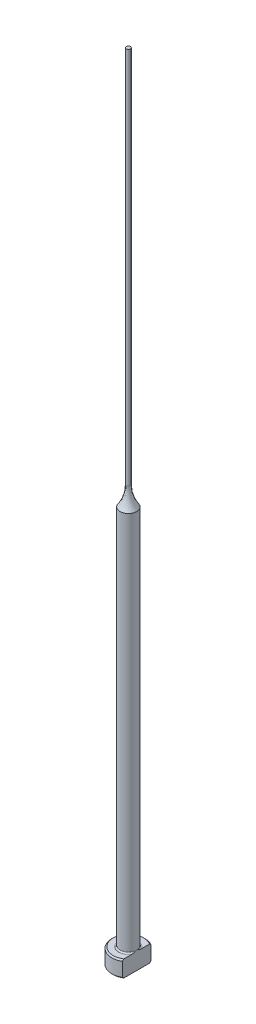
ISO-10303-21;
HEADER;
FILE_DESCRIPTION(('STEP AP214'),'2;1');
FILE_NAME('part.step','',(''),(''),'','','');
FILE_SCHEMA(('AUTOMOTIVE_DESIGN { 1 0 10303 214 1 1 1 1 }'));
ENDSEC;
DATA;
#1=APPLICATION_CONTEXT('core data for automotive mechanical design processes');
#2=APPLICATION_PROTOCOL_DEFINITION('international standard','automotive_design',2000,#1);
#3=PRODUCT_CONTEXT('',#1,'mechanical');
#4=PRODUCT('Part','Part','',(#3));
#5=PRODUCT_RELATED_PRODUCT_CATEGORY('part','',(#4));
#6=PRODUCT_DEFINITION_FORMATION('','',#4);
#7=PRODUCT_DEFINITION_CONTEXT('part definition',#1,'design');
#8=PRODUCT_DEFINITION('design','',#6,#7);
#9=PRODUCT_DEFINITION_SHAPE('','',#8);
#10=(LENGTH_UNIT() NAMED_UNIT(*) SI_UNIT(.MILLI.,.METRE.));
#11=(NAMED_UNIT(*) PLANE_ANGLE_UNIT() SI_UNIT($,.RADIAN.));
#12=(NAMED_UNIT(*) SI_UNIT($,.STERADIAN.) SOLID_ANGLE_UNIT());
#13=UNCERTAINTY_MEASURE_WITH_UNIT(LENGTH_MEASURE(1.E-05),#10,'distance_accuracy_value','');
#14=(GEOMETRIC_REPRESENTATION_CONTEXT(3) GLOBAL_UNCERTAINTY_ASSIGNED_CONTEXT((#13)) GLOBAL_UNIT_ASSIGNED_CONTEXT((#10,
#11,#12)) REPRESENTATION_CONTEXT('',''));
#15=CARTESIAN_POINT('',(0.,0.,0.));
#16=DIRECTION('',(0.,0.,1.));
#17=DIRECTION('',(1.,0.,0.));
#18=AXIS2_PLACEMENT_3D('',#15,#16,#17);
#19=CARTESIAN_POINT('',(-3.17499999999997,3.175,0.));
#20=DIRECTION('',(0.,1.,0.));
#21=DIRECTION('',(0.,0.,1.));
#22=AXIS2_PLACEMENT_3D('',#19,#20,#21);
#23=PLANE('',#22);
#24=CARTESIAN_POINT('',(0.,3.175,0.));
#25=DIRECTION('',(0.,1.,0.));
#26=DIRECTION('',(0.,0.,1.));
#27=AXIS2_PLACEMENT_3D('',#24,#25,#26);
#28=CIRCLE('',#27,2.92099999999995);
#29=CARTESIAN_POINT('',(1.58749999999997,3.175,-2.45195529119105));
#30=VERTEX_POINT('',#29);
#31=CARTESIAN_POINT('',(1.58749999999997,3.175,2.45195529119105));
#32=VERTEX_POINT('',#31);
#33=EDGE_CURVE('E105',#30,#32,#28,.T.);
#34=ORIENTED_EDGE('',*,*,#33,.T.);
#35=DIRECTION('',(0.,0.,1.));
#36=VECTOR('',#35,1.);
#37=CARTESIAN_POINT('',(1.58749999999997,3.17500000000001,2.74963065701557));
#38=LINE('',#37,#36);
#39=CARTESIAN_POINT('',(1.58749999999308,3.175,0.933255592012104));
#40=VERTEX_POINT('',#39);
#41=EDGE_CURVE('E126',#40,#32,#38,.T.);
#42=ORIENTED_EDGE('',*,*,#41,.F.);
#43=CARTESIAN_POINT('',(0.,3.175,0.));
#44=DIRECTION('',(0.,1.,0.));
#45=DIRECTION('',(0.,0.,1.));
#46=AXIS2_PLACEMENT_3D('',#43,#44,#45);
#47=CIRCLE('',#46,1.84149999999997);
#48=CARTESIAN_POINT('',(1.58749999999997,3.17500000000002,-0.933255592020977));
#49=VERTEX_POINT('',#48);
#50=EDGE_CURVE('E11',#40,#49,#47,.F.);
#51=ORIENTED_EDGE('',*,*,#50,.T.);
#52=EDGE_CURVE('E52',#30,#49,#38,.T.);
#53=ORIENTED_EDGE('',*,*,#52,.F.);
#54=EDGE_LOOP('',(#34,#42,#51,#53));
#55=FACE_BOUND('',#54,.T.);
#56=ADVANCED_FACE('F32',(#55),#23,.T.);
#57=CARTESIAN_POINT('',(0.,259.958771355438,0.));
#58=DIRECTION('',(0.,1.,0.));
#59=DIRECTION('',(0.,0.,1.));
#60=AXIS2_PLACEMENT_3D('',#57,#58,#59);
#61=CYLINDRICAL_SURFACE('',#60,3.17499999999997);
#62=CARTESIAN_POINT('',(0.,2.92100000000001,0.));
#63=DIRECTION('',(0.,1.,0.));
#64=DIRECTION('',(0.,0.,1.));
#65=AXIS2_PLACEMENT_3D('',#62,#63,#64);
#66=CIRCLE('',#65,3.17499999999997);
#67=CARTESIAN_POINT('',(1.58749999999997,2.92100000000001,2.74963065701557));
#68=VERTEX_POINT('',#67);
#69=CARTESIAN_POINT('',(1.58749999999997,2.92100000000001,-2.74963065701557));
#70=VERTEX_POINT('',#69);
#71=EDGE_CURVE('E98',#68,#70,#66,.F.);
#72=ORIENTED_EDGE('',*,*,#71,.T.);
#73=DIRECTION('',(0.,-1.,0.));
#74=VECTOR('',#73,1.);
#75=CARTESIAN_POINT('',(1.58749999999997,152.401,-2.74963065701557));
#76=LINE('',#75,#74);
#77=CARTESIAN_POINT('',(1.58749999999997,0.254000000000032,-2.74963065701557));
#78=VERTEX_POINT('',#77);
#79=EDGE_CURVE('E141',#70,#78,#76,.T.);
#80=ORIENTED_EDGE('',*,*,#79,.T.);
#81=CARTESIAN_POINT('',(0.,0.254000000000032,0.));
#82=DIRECTION('',(0.,-1.,0.));
#83=DIRECTION('',(0.,0.,-1.));
#84=AXIS2_PLACEMENT_3D('',#81,#82,#83);
#85=CIRCLE('',#84,3.17499999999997);
#86=CARTESIAN_POINT('',(1.58749999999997,0.254000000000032,2.74963065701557));
#87=VERTEX_POINT('',#86);
#88=EDGE_CURVE('E95',#78,#87,#85,.F.);
#89=ORIENTED_EDGE('',*,*,#88,.T.);
#90=DIRECTION('',(0.,-1.,0.));
#91=VECTOR('',#90,1.);
#92=CARTESIAN_POINT('',(1.58749999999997,152.401,2.74963065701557));
#93=LINE('',#92,#91);
#94=EDGE_CURVE('E88',#68,#87,#93,.T.);
#95=ORIENTED_EDGE('',*,*,#94,.F.);
#96=EDGE_LOOP('',(#72,#80,#89,#95));
#97=FACE_BOUND('',#96,.T.);
#98=ADVANCED_FACE('F191',(#97),#61,.T.);
#99=CARTESIAN_POINT('',(0.,0.,0.));
#100=DIRECTION('',(0.,-1.,0.));
#101=DIRECTION('',(0.,0.,-1.));
#102=AXIS2_PLACEMENT_3D('',#99,#100,#101);
#103=PLANE('',#102);
#104=CARTESIAN_POINT('',(0.,0.,0.));
#105=DIRECTION('',(0.,-1.,0.));
#106=DIRECTION('',(0.,0.,-1.));
#107=AXIS2_PLACEMENT_3D('',#104,#105,#106);
#108=CIRCLE('',#107,2.92099999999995);
#109=CARTESIAN_POINT('',(1.58749999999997,0.,2.45195529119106));
#110=VERTEX_POINT('',#109);
#111=CARTESIAN_POINT('',(1.58749999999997,0.,-2.45195529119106));
#112=VERTEX_POINT('',#111);
#113=EDGE_CURVE('E93',#110,#112,#108,.T.);
#114=ORIENTED_EDGE('',*,*,#113,.T.);
#115=DIRECTION('',(0.,0.,1.));
#116=VECTOR('',#115,1.);
#117=CARTESIAN_POINT('',(1.58749999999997,0.,2.74963065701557));
#118=LINE('',#117,#116);
#119=EDGE_CURVE('E78',#112,#110,#118,.T.);
#120=ORIENTED_EDGE('',*,*,#119,.T.);
#121=EDGE_LOOP('',(#114,#120));
#122=FACE_BOUND('',#121,.T.);
#123=ADVANCED_FACE('F97',(#122),#103,.T.);
#124=CARTESIAN_POINT('',(0.,3.17499999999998,0.));
#125=DIRECTION('',(0.,-1.,0.));
#126=DIRECTION('',(0.,0.,-1.));
#127=AXIS2_PLACEMENT_3D('',#124,#125,#126);
#128=CONICAL_SURFACE('',#127,2.92099999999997,0.7853981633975);
#129=ORIENTED_EDGE('',*,*,#71,.F.);
#130=CARTESIAN_POINT('',(1.58749999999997,-0.161620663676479,-6.0529050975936));
#131=CARTESIAN_POINT('',(1.58749999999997,-0.0288893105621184,-5.91567682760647));
#132=CARTESIAN_POINT('',(1.58749999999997,0.103699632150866,-5.77831035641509));
#133=CARTESIAN_POINT('',(1.58749999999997,0.36850839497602,-5.5032187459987));
#134=CARTESIAN_POINT('',(1.58749999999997,0.500728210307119,-5.36549360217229));
#135=CARTESIAN_POINT('',(1.58749999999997,0.764778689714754,-5.08953516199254));
#136=CARTESIAN_POINT('',(1.58749999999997,0.896609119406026,-4.95130164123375));
#137=CARTESIAN_POINT('',(1.58749999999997,1.15968706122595,-4.67428233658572));
#138=CARTESIAN_POINT('',(1.58749999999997,1.29093457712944,-4.53549655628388));
#139=CARTESIAN_POINT('',(1.58749999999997,1.55007705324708,-4.25997724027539));
#140=CARTESIAN_POINT('',(1.58749999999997,1.67798684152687,-4.12325766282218));
#141=CARTESIAN_POINT('',(1.58749999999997,1.93284861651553,-3.84892898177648));
#142=CARTESIAN_POINT('',(1.58749999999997,2.05980060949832,-3.71131988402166));
#143=CARTESIAN_POINT('',(1.58749999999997,2.31237508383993,-3.43493978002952));
#144=CARTESIAN_POINT('',(1.58749999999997,2.43799784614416,-3.29616903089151));
#145=CARTESIAN_POINT('',(1.58749999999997,2.68741369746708,-3.01699558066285));
#146=CARTESIAN_POINT('',(1.58749999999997,2.81120686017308,-2.87659294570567));
#147=CARTESIAN_POINT('',(1.58749999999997,3.0087586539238,-2.6481670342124));
#148=CARTESIAN_POINT('',(1.58749999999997,3.08336151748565,-2.56087478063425));
#149=CARTESIAN_POINT('',(1.58749999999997,3.23123871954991,-2.38515423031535));
#150=CARTESIAN_POINT('',(1.58749999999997,3.30451292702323,-2.29672582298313));
#151=CARTESIAN_POINT('',(1.58749999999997,3.45004422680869,-2.1174740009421));
#152=CARTESIAN_POINT('',(1.58749999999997,3.52228237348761,-2.02663514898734));
#153=CARTESIAN_POINT('',(1.58749999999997,3.6642309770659,-1.8430252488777));
#154=CARTESIAN_POINT('',(1.58749999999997,3.73394203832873,-1.75025467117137));
#155=CARTESIAN_POINT('',(1.58749999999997,3.87080633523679,-1.56067475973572));
#156=CARTESIAN_POINT('',(1.58749999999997,3.93790459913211,-1.46382547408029));
#157=CARTESIAN_POINT('',(1.58749999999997,4.06669147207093,-1.26632594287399));
#158=CARTESIAN_POINT('',(1.58749999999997,4.12837264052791,-1.16567073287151));
#159=CARTESIAN_POINT('',(1.58749999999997,4.2140225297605,-1.01165766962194));
#160=CARTESIAN_POINT('',(1.58749999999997,4.24127929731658,-0.960142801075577));
#161=CARTESIAN_POINT('',(1.58749999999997,4.29309798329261,-0.855780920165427));
#162=CARTESIAN_POINT('',(1.58749999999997,4.31765941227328,-0.802933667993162));
#163=CARTESIAN_POINT('',(1.58749999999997,4.38614656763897,-0.64246114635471));
#164=CARTESIAN_POINT('',(1.58749999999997,4.42510149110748,-0.532518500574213));
#165=CARTESIAN_POINT('',(1.58749999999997,4.46726244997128,-0.367680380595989));
#166=CARTESIAN_POINT('',(1.58749999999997,4.47844427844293,-0.314802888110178));
#167=CARTESIAN_POINT('',(1.58749999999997,4.495766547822,-0.2082097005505));
#168=CARTESIAN_POINT('',(1.58749999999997,4.50190743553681,-0.154494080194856));
#169=CARTESIAN_POINT('',(1.58749999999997,4.50871296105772,-0.0468792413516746));
#170=CARTESIAN_POINT('',(1.58749999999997,4.50939451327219,0.0070188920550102));
#171=CARTESIAN_POINT('',(1.58749999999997,4.50527679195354,0.114606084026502));
#172=CARTESIAN_POINT('',(1.58749999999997,4.50047706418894,0.168295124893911));
#173=CARTESIAN_POINT('',(1.58749999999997,4.48579689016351,0.274485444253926));
#174=CARTESIAN_POINT('',(1.58749999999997,4.47596081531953,0.326992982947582));
#175=CARTESIAN_POINT('',(1.58749999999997,4.45181809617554,0.430974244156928));
#176=CARTESIAN_POINT('',(1.58749999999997,4.43750969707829,0.48244755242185));
#177=CARTESIAN_POINT('',(1.58749999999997,4.40502489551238,0.584460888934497));
#178=CARTESIAN_POINT('',(1.58749999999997,4.38682724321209,0.634994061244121));
#179=CARTESIAN_POINT('',(1.58749999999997,4.34729308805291,0.734789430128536));
#180=CARTESIAN_POINT('',(1.58749999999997,4.32595722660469,0.784051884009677));
#181=CARTESIAN_POINT('',(1.58749999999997,4.25791922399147,0.930549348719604));
#182=CARTESIAN_POINT('',(1.58749999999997,4.20736047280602,1.02598802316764));
#183=CARTESIAN_POINT('',(1.58749999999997,4.09955451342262,1.2130431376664));
#184=CARTESIAN_POINT('',(1.58749999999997,4.04229912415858,1.30465471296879));
#185=CARTESIAN_POINT('',(1.58749999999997,3.9230874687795,1.4852621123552));
#186=CARTESIAN_POINT('',(1.58749999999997,3.86111349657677,1.57424615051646));
#187=CARTESIAN_POINT('',(1.58749999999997,3.73408621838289,1.74990003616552));
#188=CARTESIAN_POINT('',(1.58749999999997,3.66903444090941,1.8365709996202));
#189=CARTESIAN_POINT('',(1.58749999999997,3.53583371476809,2.00931764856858));
#190=CARTESIAN_POINT('',(1.58749999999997,3.46765527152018,2.09537048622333));
#191=CARTESIAN_POINT('',(1.58749999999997,3.32960643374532,2.26611736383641));
#192=CARTESIAN_POINT('',(1.58749999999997,3.25973586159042,2.35081125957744));
#193=CARTESIAN_POINT('',(1.58749999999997,3.04858139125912,2.60290121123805));
#194=CARTESIAN_POINT('',(1.58749999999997,2.90542388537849,2.76872537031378));
#195=CARTESIAN_POINT('',(1.58749999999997,2.64069522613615,3.06970913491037));
#196=CARTESIAN_POINT('',(1.58749999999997,2.5195945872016,3.20528660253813));
#197=CARTESIAN_POINT('',(1.58749999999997,2.275904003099,3.47510321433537));
#198=CARTESIAN_POINT('',(1.58749999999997,2.15331401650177,3.60934232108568));
#199=CARTESIAN_POINT('',(1.58749999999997,1.90694239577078,3.87695374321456));
#200=CARTESIAN_POINT('',(1.58749999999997,1.78315974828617,4.01032512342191));
#201=CARTESIAN_POINT('',(1.58749999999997,1.53478104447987,4.2763088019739));
#202=CARTESIAN_POINT('',(1.58749999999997,1.41018498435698,4.40892109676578));
#203=CARTESIAN_POINT('',(1.58749999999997,1.0457468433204,4.79499418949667));
#204=CARTESIAN_POINT('',(1.58749999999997,0.805076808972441,5.04767313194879));
#205=CARTESIAN_POINT('',(1.58749999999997,0.443121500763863,5.42550911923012));
#206=CARTESIAN_POINT('',(1.58749999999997,0.322378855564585,5.55118772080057));
#207=CARTESIAN_POINT('',(1.58749999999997,0.0805914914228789,5.80225207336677));
#208=CARTESIAN_POINT('',(1.58749999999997,-0.0404532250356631,5.92763782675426));
#209=CARTESIAN_POINT('',(1.58749999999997,-0.161620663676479,6.0529050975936));
#210=B_SPLINE_CURVE_WITH_KNOTS('',3,(#130,#131,#132,#133,#134,#135,#136,#137,#138,#139,#140,
#141,#142,#143,#144,#145,#146,#147,#148,#149,#150,#151,#152,#153,#154,#155,#156,#157,#158,#159,
#160,#161,#162,#163,#164,#165,#166,#167,#168,#169,#170,#171,#172,#173,#174,#175,#176,#177,#178,
#179,#180,#181,#182,#183,#184,#185,#186,#187,#188,#189,#190,#191,#192,#193,#194,#195,#196,#197,
#198,#199,#200,#201,#202,#203,#204,#205,#206,#207,#208,#209),.UNSPECIFIED.,.F.,.F.,(4,2,2,2,2,2,
2,2,2,2,2,2,2,2,2,2,2,2,2,2,2,2,2,2,2,2,2,2,2,2,2,2,2,2,2,2,2,2,2,4),(0.,0.572750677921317,
1.14550874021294,1.71856057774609,2.29160869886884,2.85328006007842,3.41494773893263,
3.97649423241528,4.53801804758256,4.88249307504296,5.22700189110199,5.57515326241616,
5.92322081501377,6.27657800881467,6.63041319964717,6.80518126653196,6.97998101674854,
7.32824262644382,7.49018491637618,7.65211285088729,7.813538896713,7.97497832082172,
8.13501929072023,8.29512313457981,8.4561251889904,8.61709438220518,8.94062993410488,
9.26456495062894,9.58978187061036,9.91483894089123,10.2441741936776,10.5735441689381,
11.2306812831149,11.7760337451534,12.3214014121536,12.8672825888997,13.4131663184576,
14.4600164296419,14.9828595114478,15.505698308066),.UNSPECIFIED.);
#211=EDGE_CURVE('E118',#32,#68,#210,.T.);
#212=ORIENTED_EDGE('',*,*,#211,.F.);
#213=ORIENTED_EDGE('',*,*,#33,.F.);
#214=EDGE_CURVE('E117',#70,#30,#210,.T.);
#215=ORIENTED_EDGE('',*,*,#214,.F.);
#216=EDGE_LOOP('',(#129,#212,#213,#215));
#217=FACE_BOUND('',#216,.T.);
#218=ADVANCED_FACE('F162',(#217),#128,.T.);
#219=CARTESIAN_POINT('',(0.,0.254000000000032,0.));
#220=DIRECTION('',(0.,1.,0.));
#221=DIRECTION('',(0.,0.,1.));
#222=AXIS2_PLACEMENT_3D('',#219,#220,#221);
#223=CONICAL_SURFACE('',#222,3.17499999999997,0.785398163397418);
#224=ORIENTED_EDGE('',*,*,#88,.F.);
#225=CARTESIAN_POINT('',(1.58749999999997,3.33662066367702,6.0529050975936));
#226=CARTESIAN_POINT('',(1.58749999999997,3.20388931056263,5.91567682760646));
#227=CARTESIAN_POINT('',(1.58749999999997,3.0713003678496,5.77831035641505));
#228=CARTESIAN_POINT('',(1.58749999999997,2.80649160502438,5.50321874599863));
#229=CARTESIAN_POINT('',(1.58749999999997,2.67427178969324,5.36549360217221));
#230=CARTESIAN_POINT('',(1.58749999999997,2.41022131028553,5.08953516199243));
#231=CARTESIAN_POINT('',(1.58749999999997,2.27839088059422,4.95130164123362));
#232=CARTESIAN_POINT('',(1.58749999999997,2.01531293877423,4.67428233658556));
#233=CARTESIAN_POINT('',(1.58749999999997,1.8840654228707,4.5354965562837));
#234=CARTESIAN_POINT('',(1.58749999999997,1.62492294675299,4.25997724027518));
#235=CARTESIAN_POINT('',(1.58749999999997,1.49701315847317,4.12325766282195));
#236=CARTESIAN_POINT('',(1.58749999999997,1.24215138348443,3.84892898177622));
#237=CARTESIAN_POINT('',(1.58749999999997,1.11519939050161,3.71131988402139));
#238=CARTESIAN_POINT('',(1.58749999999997,0.862624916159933,3.43493978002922));
#239=CARTESIAN_POINT('',(1.58749999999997,0.737002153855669,3.29616903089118));
#240=CARTESIAN_POINT('',(1.58749999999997,0.487586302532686,3.01699558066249));
#241=CARTESIAN_POINT('',(1.58749999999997,0.363793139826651,2.8765929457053));
#242=CARTESIAN_POINT('',(1.58749999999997,0.1662413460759,2.64816703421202));
#243=CARTESIAN_POINT('',(1.58749999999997,0.0916384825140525,2.56087478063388));
#244=CARTESIAN_POINT('',(1.58749999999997,-0.0562387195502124,2.385154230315));
#245=CARTESIAN_POINT('',(1.58749999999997,-0.129512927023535,2.29672582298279));
#246=CARTESIAN_POINT('',(1.58749999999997,-0.275044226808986,2.11747400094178));
#247=CARTESIAN_POINT('',(1.58749999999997,-0.34728237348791,2.02663514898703));
#248=CARTESIAN_POINT('',(1.58749999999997,-0.489230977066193,1.84302524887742));
#249=CARTESIAN_POINT('',(1.58749999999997,-0.558942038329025,1.75025467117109));
#250=CARTESIAN_POINT('',(1.58749999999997,-0.695806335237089,1.56067475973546));
#251=CARTESIAN_POINT('',(1.58749999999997,-0.762904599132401,1.46382547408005));
#252=CARTESIAN_POINT('',(1.58749999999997,-0.89169147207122,1.26632594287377));
#253=CARTESIAN_POINT('',(1.58749999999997,-0.953372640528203,1.16567073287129));
#254=CARTESIAN_POINT('',(1.58749999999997,-1.03902252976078,1.01165766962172));
#255=CARTESIAN_POINT('',(1.58749999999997,-1.06627929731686,0.960142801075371));
#256=CARTESIAN_POINT('',(1.58749999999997,-1.11809798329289,0.855780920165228));
#257=CARTESIAN_POINT('',(1.58749999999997,-1.14265941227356,0.802933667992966));
#258=CARTESIAN_POINT('',(1.58749999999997,-1.21114656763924,0.642461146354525));
#259=CARTESIAN_POINT('',(1.58749999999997,-1.25010149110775,0.532518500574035));
#260=CARTESIAN_POINT('',(1.58749999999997,-1.29226244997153,0.36768038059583));
#261=CARTESIAN_POINT('',(1.58749999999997,-1.30344427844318,0.31480288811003));
#262=CARTESIAN_POINT('',(1.58749999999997,-1.32076654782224,0.208209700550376));
#263=CARTESIAN_POINT('',(1.58749999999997,-1.32690743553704,0.154494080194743));
#264=CARTESIAN_POINT('',(1.58749999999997,-1.33371296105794,0.0468792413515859));
#265=CARTESIAN_POINT('',(1.58749999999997,-1.33439451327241,-0.0070188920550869));
#266=CARTESIAN_POINT('',(1.58749999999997,-1.33027679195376,-0.114606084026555));
#267=CARTESIAN_POINT('',(1.58749999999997,-1.32547706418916,-0.168295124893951));
#268=CARTESIAN_POINT('',(1.58749999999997,-1.31079689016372,-0.274485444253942));
#269=CARTESIAN_POINT('',(1.58749999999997,-1.30096081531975,-0.326992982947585));
#270=CARTESIAN_POINT('',(1.58749999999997,-1.27681809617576,-0.430974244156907));
#271=CARTESIAN_POINT('',(1.58749999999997,-1.26250969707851,-0.482447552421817));
#272=CARTESIAN_POINT('',(1.58749999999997,-1.2300248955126,-0.584460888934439));
#273=CARTESIAN_POINT('',(1.58749999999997,-1.21182724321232,-0.634994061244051));
#274=CARTESIAN_POINT('',(1.58749999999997,-1.17229308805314,-0.734789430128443));
#275=CARTESIAN_POINT('',(1.58749999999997,-1.15095722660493,-0.784051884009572));
#276=CARTESIAN_POINT('',(1.58749999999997,-1.08291922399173,-0.93054934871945));
#277=CARTESIAN_POINT('',(1.58749999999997,-1.0323604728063,-1.02598802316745));
#278=CARTESIAN_POINT('',(1.58749999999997,-0.92455451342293,-1.21304313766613));
#279=CARTESIAN_POINT('',(1.58749999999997,-0.867299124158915,-1.30465471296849));
#280=CARTESIAN_POINT('',(1.58749999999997,-0.748087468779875,-1.48526211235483));
#281=CARTESIAN_POINT('',(1.58749999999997,-0.686113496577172,-1.57424615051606));
#282=CARTESIAN_POINT('',(1.58749999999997,-0.559086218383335,-1.74990003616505));
#283=CARTESIAN_POINT('',(1.58749999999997,-0.494034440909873,-1.83657099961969));
#284=CARTESIAN_POINT('',(1.58749999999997,-0.360833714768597,-2.00931764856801));
#285=CARTESIAN_POINT('',(1.58749999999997,-0.292655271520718,-2.09537048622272));
#286=CARTESIAN_POINT('',(1.58749999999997,-0.154606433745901,-2.26611736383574));
#287=CARTESIAN_POINT('',(1.58749999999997,-0.084735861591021,-2.35081125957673));
#288=CARTESIAN_POINT('',(1.58749999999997,0.126418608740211,-2.60290121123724));
#289=CARTESIAN_POINT('',(1.58749999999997,0.26957611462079,-2.76872537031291));
#290=CARTESIAN_POINT('',(1.58749999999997,0.534304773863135,-3.06970913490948));
#291=CARTESIAN_POINT('',(1.58749999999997,0.655405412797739,-3.20528660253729));
#292=CARTESIAN_POINT('',(1.58749999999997,0.899095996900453,-3.47510321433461));
#293=CARTESIAN_POINT('',(1.58749999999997,1.02168598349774,-3.60934232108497));
#294=CARTESIAN_POINT('',(1.58749999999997,1.26805760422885,-3.87695374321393));
#295=CARTESIAN_POINT('',(1.58749999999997,1.39184025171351,-4.01032512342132));
#296=CARTESIAN_POINT('',(1.58749999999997,1.64021895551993,-4.2763088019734));
#297=CARTESIAN_POINT('',(1.58749999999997,1.76481501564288,-4.40892109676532));
#298=CARTESIAN_POINT('',(1.58749999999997,2.12925315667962,-4.79499418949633));
#299=CARTESIAN_POINT('',(1.58749999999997,2.36992319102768,-5.04767313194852));
#300=CARTESIAN_POINT('',(1.58749999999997,2.73187849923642,-5.42550911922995));
#301=CARTESIAN_POINT('',(1.58749999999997,2.85262114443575,-5.55118772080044));
#302=CARTESIAN_POINT('',(1.58749999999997,3.09440850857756,-5.8022520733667));
#303=CARTESIAN_POINT('',(1.58749999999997,3.21545322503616,-5.92763782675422));
#304=CARTESIAN_POINT('',(1.58749999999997,3.33662066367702,-6.0529050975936));
#305=B_SPLINE_CURVE_WITH_KNOTS('',3,(#225,#226,#227,#228,#229,#230,#231,#232,#233,#234,#235,
#236,#237,#238,#239,#240,#241,#242,#243,#244,#245,#246,#247,#248,#249,#250,#251,#252,#253,#254,
#255,#256,#257,#258,#259,#260,#261,#262,#263,#264,#265,#266,#267,#268,#269,#270,#271,#272,#273,
#274,#275,#276,#277,#278,#279,#280,#281,#282,#283,#284,#285,#286,#287,#288,#289,#290,#291,#292,
#293,#294,#295,#296,#297,#298,#299,#300,#301,#302,#303,#304),.UNSPECIFIED.,.F.,.F.,(4,2,2,2,2,2,
2,2,2,2,2,2,2,2,2,2,2,2,2,2,2,2,2,2,2,2,2,2,2,2,2,2,2,2,2,2,2,2,2,4),(0.,0.572750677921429,
1.14550874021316,1.71856057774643,2.29160869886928,2.85328006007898,3.41494773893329,
3.97649423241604,4.53801804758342,4.8824930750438,5.22700189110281,5.57515326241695,
5.92322081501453,6.27657800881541,6.63041319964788,6.80518126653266,6.97998101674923,
7.32824262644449,7.49018491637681,7.65211285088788,7.81353889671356,7.97497832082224,
8.13501929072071,8.29512313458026,8.45612518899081,8.61709438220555,8.94062993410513,
9.26456495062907,9.58978187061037,9.91483894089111,10.2441741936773,10.5735441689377,
11.2306812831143,11.776033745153,12.3214014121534,12.8672825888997,13.4131663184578,
14.4600164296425,14.9828595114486,15.505698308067),.UNSPECIFIED.);
#306=EDGE_CURVE('E81',#112,#78,#305,.T.);
#307=ORIENTED_EDGE('',*,*,#306,.F.);
#308=ORIENTED_EDGE('',*,*,#113,.F.);
#309=EDGE_CURVE('E84',#87,#110,#305,.T.);
#310=ORIENTED_EDGE('',*,*,#309,.F.);
#311=EDGE_LOOP('',(#224,#307,#308,#310));
#312=FACE_BOUND('',#311,.T.);
#313=ADVANCED_FACE('F92',(#312),#223,.T.);
#314=CARTESIAN_POINT('',(0.,3.42900000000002,0.));
#315=DIRECTION('',(0.,1.,0.));
#316=DIRECTION('',(0.,0.,1.));
#317=AXIS2_PLACEMENT_3D('',#314,#315,#316);
#318=TOROIDAL_SURFACE('',#317,1.84149999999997,0.254);
#319=CARTESIAN_POINT('',(1.58749999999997,3.42900000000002,0.));
#320=CARTESIAN_POINT('',(1.58749999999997,3.42899942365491,-1.9220514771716E-10));
#321=CARTESIAN_POINT('',(1.58749999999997,3.42899884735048,-1.2261161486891E-07));
#322=CARTESIAN_POINT('',(1.58749999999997,3.42899773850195,-5.09676365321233E-07));
#323=CARTESIAN_POINT('',(1.58749999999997,3.42899720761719,-7.78176328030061E-07));
#324=CARTESIAN_POINT('',(1.58749999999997,3.42899614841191,-1.42307272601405E-06));
#325=CARTESIAN_POINT('',(1.58749999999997,3.42899562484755,-1.80713867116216E-06));
#326=CARTESIAN_POINT('',(1.58749999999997,3.42899463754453,-2.63494846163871E-06));
#327=CARTESIAN_POINT('',(1.58749999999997,3.42899417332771,-3.07814756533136E-06));
#328=CARTESIAN_POINT('',(1.58749999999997,3.42899261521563,-4.66897357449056E-06));
#329=CARTESIAN_POINT('',(1.58749999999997,3.42899159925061,-5.89404908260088E-06));
#330=CARTESIAN_POINT('',(1.58749999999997,3.42898979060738,-8.42427511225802E-06));
#331=CARTESIAN_POINT('',(1.58749999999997,3.42898899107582,-9.7248057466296E-06));
#332=CARTESIAN_POINT('',(1.58749999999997,3.42898598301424,-1.48060601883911E-05));
#333=CARTESIAN_POINT('',(1.58749999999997,3.42898393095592,-1.86838281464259E-05));
#334=CARTESIAN_POINT('',(1.58749999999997,3.42898057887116,-2.63261117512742E-05));
#335=CARTESIAN_POINT('',(1.58749999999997,3.42897922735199,-3.00687417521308E-05));
#336=CARTESIAN_POINT('',(1.58749999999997,3.42897347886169,-4.60276298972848E-05));
#337=CARTESIAN_POINT('',(1.58749999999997,3.42896911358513,-5.8247019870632E-05));
#338=CARTESIAN_POINT('',(1.58749999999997,3.42896211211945,-8.11070097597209E-05));
#339=CARTESIAN_POINT('',(1.58749999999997,3.42895931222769,-9.16953114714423E-05));
#340=CARTESIAN_POINT('',(1.58749999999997,3.42893712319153,-0.000168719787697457));
#341=CARTESIAN_POINT('',(1.58749999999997,3.42890881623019,-0.000232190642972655));
#342=CARTESIAN_POINT('',(1.58749999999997,3.42880276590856,-0.000479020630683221));
#343=CARTESIAN_POINT('',(1.58749999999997,3.42873165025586,-0.00066443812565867));
#344=CARTESIAN_POINT('',(1.58749999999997,3.42845137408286,-0.0013844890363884));
#345=CARTESIAN_POINT('',(1.58749999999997,3.42823526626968,-0.00191701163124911));
#346=CARTESIAN_POINT('',(1.58749999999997,3.42735449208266,-0.00409774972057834));
#347=CARTESIAN_POINT('',(1.58749999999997,3.42669768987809,-0.00574830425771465));
#348=CARTESIAN_POINT('',(1.58749999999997,3.4174405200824,-0.0289985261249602));
#349=CARTESIAN_POINT('',(1.58749999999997,3.40878325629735,-0.0505816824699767));
#350=CARTESIAN_POINT('',(1.58749999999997,3.39189297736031,-0.0929947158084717));
#351=CARTESIAN_POINT('',(1.58749999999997,3.38365605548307,-0.11382315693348));
#352=CARTESIAN_POINT('',(1.58749999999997,3.36635393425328,-0.157956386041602));
#353=CARTESIAN_POINT('',(1.58749999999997,3.35730391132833,-0.181267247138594));
#354=CARTESIAN_POINT('',(1.58749999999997,3.33936775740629,-0.228222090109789));
#355=CARTESIAN_POINT('',(1.58749999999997,3.33048420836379,-0.25186705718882));
#356=CARTESIAN_POINT('',(1.58749999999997,3.30894496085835,-0.310512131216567));
#357=CARTESIAN_POINT('',(1.58749999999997,3.29649449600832,-0.345588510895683));
#358=CARTESIAN_POINT('',(1.58749999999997,3.27296975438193,-0.415278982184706));
#359=CARTESIAN_POINT('',(1.58749999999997,3.26186987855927,-0.449884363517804));
#360=CARTESIAN_POINT('',(1.58749999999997,3.2395832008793,-0.524471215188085));
#361=CARTESIAN_POINT('',(1.58749999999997,3.22860862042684,-0.564517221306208));
#362=CARTESIAN_POINT('',(1.58749999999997,3.20902534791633,-0.645529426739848));
#363=CARTESIAN_POINT('',(1.58749999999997,3.20043582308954,-0.686500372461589));
#364=CARTESIAN_POINT('',(1.58749999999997,3.18611712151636,-0.771546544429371));
#365=CARTESIAN_POINT('',(1.58749999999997,3.18059550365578,-0.815658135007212));
#366=CARTESIAN_POINT('',(1.58749999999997,3.17455396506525,-0.904117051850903));
#367=CARTESIAN_POINT('',(1.58749999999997,3.17401361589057,-0.948462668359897));
#368=CARTESIAN_POINT('',(1.58749999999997,3.17898948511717,-1.02531896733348));
#369=CARTESIAN_POINT('',(1.58749999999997,3.1829739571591,-1.05792141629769));
#370=CARTESIAN_POINT('',(1.58749999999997,3.19569167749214,-1.12184393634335));
#371=CARTESIAN_POINT('',(1.58749999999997,3.20436049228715,-1.1531753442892));
#372=CARTESIAN_POINT('',(1.58749999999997,3.22236152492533,-1.19946468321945));
#373=CARTESIAN_POINT('',(1.58749999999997,3.2295150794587,-1.21526783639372));
#374=CARTESIAN_POINT('',(1.58749999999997,3.24587062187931,-1.24583726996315));
#375=CARTESIAN_POINT('',(1.58749999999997,3.25507530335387,-1.26060215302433));
#376=CARTESIAN_POINT('',(1.58749999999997,3.27378481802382,-1.28575815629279));
#377=CARTESIAN_POINT('',(1.58749999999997,3.28289001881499,-1.29644383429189));
#378=CARTESIAN_POINT('',(1.58749999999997,3.30268460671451,-1.31623154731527));
#379=CARTESIAN_POINT('',(1.58749999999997,3.31337067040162,-1.32533681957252));
#380=CARTESIAN_POINT('',(1.58749999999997,3.33349977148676,-1.33941140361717));
#381=CARTESIAN_POINT('',(1.58749999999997,3.34261446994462,-1.34484814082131));
#382=CARTESIAN_POINT('',(1.58749999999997,3.36161455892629,-1.35416329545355));
#383=CARTESIAN_POINT('',(1.58749999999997,3.37149946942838,-1.35804267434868));
#384=CARTESIAN_POINT('',(1.58749999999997,3.39188678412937,-1.36398436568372));
#385=CARTESIAN_POINT('',(1.58749999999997,3.40239309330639,-1.36603350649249));
#386=CARTESIAN_POINT('',(1.58749999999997,3.42360372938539,-1.3680840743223));
#387=CARTESIAN_POINT('',(1.58749999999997,3.43430795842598,-1.36808648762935));
#388=CARTESIAN_POINT('',(1.58749999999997,3.45433283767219,-1.36616208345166));
#389=CARTESIAN_POINT('',(1.58749999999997,3.46367506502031,-1.36444960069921));
#390=CARTESIAN_POINT('',(1.58749999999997,3.48195519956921,-1.35953338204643));
#391=CARTESIAN_POINT('',(1.58749999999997,3.49089304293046,-1.3563294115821));
#392=CARTESIAN_POINT('',(1.58749999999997,3.50850302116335,-1.34848006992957));
#393=CARTESIAN_POINT('',(1.58749999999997,3.5171531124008,-1.34378578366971));
#394=CARTESIAN_POINT('',(1.58749999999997,3.53371257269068,-1.33324445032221));
#395=CARTESIAN_POINT('',(1.58749999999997,3.54162163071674,-1.32739692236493));
#396=CARTESIAN_POINT('',(1.58749999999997,3.56107121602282,-1.31107304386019));
#397=CARTESIAN_POINT('',(1.58749999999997,3.57202221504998,-1.29989286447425));
#398=CARTESIAN_POINT('',(1.58749999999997,3.59202509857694,-1.27593566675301));
#399=CARTESIAN_POINT('',(1.58749999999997,3.60107086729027,-1.26315370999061));
#400=CARTESIAN_POINT('',(1.58749999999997,3.62186023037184,-1.22930733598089));
#401=CARTESIAN_POINT('',(1.58749999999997,3.63240584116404,-1.20751096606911));
#402=CARTESIAN_POINT('',(1.58749999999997,3.65004643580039,-1.16266144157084));
#403=CARTESIAN_POINT('',(1.58749999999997,3.65714435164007,-1.13960937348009));
#404=CARTESIAN_POINT('',(1.58749999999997,3.67265428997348,-1.07603916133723));
#405=CARTESIAN_POINT('',(1.58749999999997,3.67834921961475,-1.03486686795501));
#406=CARTESIAN_POINT('',(1.58749999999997,3.68382880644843,-0.951558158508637));
#407=CARTESIAN_POINT('',(1.58749999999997,3.68350976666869,-0.909417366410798));
#408=CARTESIAN_POINT('',(1.58749999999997,3.67745397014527,-0.811383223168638));
#409=CARTESIAN_POINT('',(1.58749999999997,3.66993873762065,-0.755610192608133));
#410=CARTESIAN_POINT('',(1.58749999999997,3.64933373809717,-0.644937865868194));
#411=CARTESIAN_POINT('',(1.58749999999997,3.63621897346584,-0.59004364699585));
#412=CARTESIAN_POINT('',(1.58749999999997,3.60740922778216,-0.485757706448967));
#413=CARTESIAN_POINT('',(1.58749999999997,3.59201096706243,-0.436281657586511));
#414=CARTESIAN_POINT('',(1.58749999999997,3.55922497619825,-0.338551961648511));
#415=CARTESIAN_POINT('',(1.58749999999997,3.5418584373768,-0.290291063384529));
#416=CARTESIAN_POINT('',(1.58749999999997,3.51760237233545,-0.225557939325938));
#417=CARTESIAN_POINT('',(1.58749999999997,3.51126413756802,-0.208874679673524));
#418=CARTESIAN_POINT('',(1.58749999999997,3.49830042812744,-0.17512392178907));
#419=CARTESIAN_POINT('',(1.58749999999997,3.49167176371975,-0.158057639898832));
#420=CARTESIAN_POINT('',(1.58749999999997,3.47585523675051,-0.117638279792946));
#421=CARTESIAN_POINT('',(1.58749999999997,3.46662970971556,-0.0943002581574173));
#422=CARTESIAN_POINT('',(1.58749999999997,3.44889695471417,-0.0497824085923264));
#423=CARTESIAN_POINT('',(1.58749999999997,3.44040039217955,-0.028598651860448));
#424=CARTESIAN_POINT('',(1.58749999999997,3.43130364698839,-0.00575168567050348));
#425=CARTESIAN_POINT('',(1.58749999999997,3.43064818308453,-0.00410451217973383));
#426=CARTESIAN_POINT('',(1.58749999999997,3.42976776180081,-0.00192459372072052));
#427=CARTESIAN_POINT('',(1.58749999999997,3.42955062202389,-0.00138952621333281));
#428=CARTESIAN_POINT('',(1.58749999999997,3.42926908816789,-0.000666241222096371));
#429=CARTESIAN_POINT('',(1.58749999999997,3.42919771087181,-0.000480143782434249));
#430=CARTESIAN_POINT('',(1.58749999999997,3.42909131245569,-0.000232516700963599));
#431=CARTESIAN_POINT('',(1.58749999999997,3.42906294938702,-0.000168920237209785));
#432=CARTESIAN_POINT('',(1.58749999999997,3.42904072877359,-9.17527162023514E-05));
#433=CARTESIAN_POINT('',(1.58749999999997,3.42903792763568,-8.11550293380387E-05));
#434=CARTESIAN_POINT('',(1.58749999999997,3.42903091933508,-5.82743948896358E-05));
#435=CARTESIAN_POINT('',(1.58749999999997,3.42902654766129,-4.60440001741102E-05));
#436=CARTESIAN_POINT('',(1.58749999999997,3.42902079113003,-3.00727682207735E-05));
#437=CARTESIAN_POINT('',(1.58749999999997,3.42901943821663,-2.63286807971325E-05));
#438=CARTESIAN_POINT('',(1.58749999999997,3.42901608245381,-1.86836529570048E-05));
#439=CARTESIAN_POINT('',(1.58749999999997,3.4290140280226,-1.48046517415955E-05));
#440=CARTESIAN_POINT('',(1.58749999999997,3.42901101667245,-9.72223943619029E-06));
#441=CARTESIAN_POINT('',(1.58749999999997,3.42901021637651,-8.42159649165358E-06));
#442=CARTESIAN_POINT('',(1.58749999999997,3.42900840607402,-5.89129729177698E-06));
#443=CARTESIAN_POINT('',(1.58749999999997,3.42900738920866,-4.66626867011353E-06));
#444=CARTESIAN_POINT('',(1.58749999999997,3.42900582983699,-3.07568803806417E-06));
#445=CARTESIAN_POINT('',(1.58749999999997,3.42900536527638,-2.63259565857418E-06));
#446=CARTESIAN_POINT('',(1.58749999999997,3.4290043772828,-1.80506085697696E-06));
#447=CARTESIAN_POINT('',(1.58749999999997,3.42900385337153,-1.42116387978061E-06));
#448=CARTESIAN_POINT('',(1.58749999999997,3.42900279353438,-7.76675643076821E-07));
#449=CARTESIAN_POINT('',(1.58749999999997,3.42900226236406,-5.08406487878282E-07));
#450=CARTESIAN_POINT('',(1.58749999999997,3.42900115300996,-1.21901887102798E-07));
#451=CARTESIAN_POINT('',(1.58749999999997,3.42900057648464,1.92251677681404E-10));
#452=CARTESIAN_POINT('',(1.58749999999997,3.42900000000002,0.));
#453=B_SPLINE_CURVE_WITH_KNOTS('',3,(#319,#320,#321,#322,#323,#324,#325,#326,#327,#328,#329,
#330,#331,#332,#333,#334,#335,#336,#337,#338,#339,#340,#341,#342,#343,#344,#345,#346,#347,#348,
#349,#350,#351,#352,#353,#354,#355,#356,#357,#358,#359,#360,#361,#362,#363,#364,#365,#366,#367,
#368,#369,#370,#371,#372,#373,#374,#375,#376,#377,#378,#379,#380,#381,#382,#383,#384,#385,#386,
#387,#388,#389,#390,#391,#392,#393,#394,#395,#396,#397,#398,#399,#400,#401,#402,#403,#404,#405,
#406,#407,#408,#409,#410,#411,#412,#413,#414,#415,#416,#417,#418,#419,#420,#421,#422,#423,#424,
#425,#426,#427,#428,#429,#430,#431,#432,#433,#434,#435,#436,#437,#438,#439,#440,#441,#442,#443,
#444,#445,#446,#447,#448,#449,#450,#451,#452),.UNSPECIFIED.,.T.,.F.,(4,2,2,2,2,2,2,2,2,2,2,2,2,
2,2,2,2,2,2,2,2,2,2,2,2,2,2,2,2,2,2,2,2,2,2,2,2,2,2,2,2,2,2,2,2,2,2,2,2,2,2,2,2,2,2,2,2,2,2,2,2,
2,2,2,2,2,4),(0.,1.72815458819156E-06,3.50429255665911E-06,5.44431004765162E-06,
7.3675525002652E-06,1.2119089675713E-05,1.66953775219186E-05,2.98160400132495E-05,
4.17409564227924E-05,8.0660475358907E-05,0.000113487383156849,0.000321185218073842,
0.000917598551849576,0.00264089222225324,0.00797105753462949,0.0777276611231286,
0.144923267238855,0.219939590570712,0.295714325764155,0.407362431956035,0.516367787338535,
0.640878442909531,0.766362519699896,0.899536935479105,1.03216495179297,1.13045740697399,
1.22743103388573,1.27935899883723,1.33135556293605,1.37333248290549,1.41522237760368,
1.44693946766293,1.47863694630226,1.51056074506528,1.54246916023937,1.57083210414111,
1.59919951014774,1.62861579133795,1.65804436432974,1.70472658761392,1.75155645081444,
1.82378709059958,1.89595619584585,2.01995471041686,2.1460932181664,2.31447224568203,
2.48361094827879,2.6389891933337,2.79283011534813,2.84637031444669,2.9012946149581,
2.97658236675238,3.04504771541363,3.05036697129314,3.05209849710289,3.05269709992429,
3.05290520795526,3.05293806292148,3.05297701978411,3.05298895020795,3.05300207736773,
3.05300665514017,3.0530114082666,3.05301333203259,3.05301527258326,3.05301704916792,
3.05301877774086),.UNSPECIFIED.);
#454=CARTESIAN_POINT('',(1.58749999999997,3.42900000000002,0.));
#455=VERTEX_POINT('',#454);
#456=EDGE_CURVE('E47',#455,#49,#453,.T.);
#457=ORIENTED_EDGE('',*,*,#456,.T.);
#458=ORIENTED_EDGE('',*,*,#50,.F.);
#459=CARTESIAN_POINT('',(1.58749999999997,3.42900000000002,0.));
#460=CARTESIAN_POINT('',(1.58749999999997,3.42900057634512,1.9220512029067E-10));
#461=CARTESIAN_POINT('',(1.58749999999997,3.42900115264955,1.22611614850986E-07));
#462=CARTESIAN_POINT('',(1.58749999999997,3.42900226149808,5.09676365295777E-07));
#463=CARTESIAN_POINT('',(1.58749999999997,3.42900279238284,7.78176328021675E-07));
#464=CARTESIAN_POINT('',(1.58749999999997,3.42900385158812,1.42307272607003E-06));
#465=CARTESIAN_POINT('',(1.58749999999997,3.42900437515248,1.80713867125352E-06));
#466=CARTESIAN_POINT('',(1.58749999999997,3.4290053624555,2.63494846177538E-06));
#467=CARTESIAN_POINT('',(1.58749999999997,3.42900582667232,3.0781475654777E-06));
#468=CARTESIAN_POINT('',(1.58749999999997,3.4290073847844,4.66897357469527E-06));
#469=CARTESIAN_POINT('',(1.58749999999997,3.42900840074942,5.89404908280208E-06));
#470=CARTESIAN_POINT('',(1.58749999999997,3.42901020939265,8.42427511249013E-06));
#471=CARTESIAN_POINT('',(1.58749999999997,3.42901100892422,9.72480574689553E-06));
#472=CARTESIAN_POINT('',(1.58749999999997,3.42901401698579,1.48060601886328E-05));
#473=CARTESIAN_POINT('',(1.58749999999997,3.42901606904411,1.86838281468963E-05));
#474=CARTESIAN_POINT('',(1.58749999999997,3.42901942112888,2.63261117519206E-05));
#475=CARTESIAN_POINT('',(1.58749999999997,3.42902077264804,3.00687417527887E-05));
#476=CARTESIAN_POINT('',(1.58749999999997,3.42902652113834,4.60276298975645E-05));
#477=CARTESIAN_POINT('',(1.58749999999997,3.4290308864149,5.82470198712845E-05));
#478=CARTESIAN_POINT('',(1.58749999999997,3.42903788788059,8.11070097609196E-05));
#479=CARTESIAN_POINT('',(1.58749999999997,3.42904068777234,9.16953114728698E-05));
#480=CARTESIAN_POINT('',(1.58749999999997,3.4290628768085,0.000168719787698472));
#481=CARTESIAN_POINT('',(1.58749999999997,3.42909118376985,0.000232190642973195));
#482=CARTESIAN_POINT('',(1.58749999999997,3.42919723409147,0.000479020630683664));
#483=CARTESIAN_POINT('',(1.58749999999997,3.42926834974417,0.000664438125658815));
#484=CARTESIAN_POINT('',(1.58749999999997,3.42954862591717,0.00138448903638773));
#485=CARTESIAN_POINT('',(1.58749999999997,3.42976473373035,0.00191701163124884));
#486=CARTESIAN_POINT('',(1.58749999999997,3.43064550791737,0.00409774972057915));
#487=CARTESIAN_POINT('',(1.58749999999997,3.43130231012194,0.00574830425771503));
#488=CARTESIAN_POINT('',(1.58749999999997,3.44055947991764,0.0289985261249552));
#489=CARTESIAN_POINT('',(1.58749999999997,3.44921674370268,0.0505816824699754));
#490=CARTESIAN_POINT('',(1.58749999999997,3.46610702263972,0.0929947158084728));
#491=CARTESIAN_POINT('',(1.58749999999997,3.47434394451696,0.11382315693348));
#492=CARTESIAN_POINT('',(1.58749999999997,3.49164606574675,0.157956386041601));
#493=CARTESIAN_POINT('',(1.58749999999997,3.5006960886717,0.181267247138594));
#494=CARTESIAN_POINT('',(1.58749999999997,3.51863224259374,0.228222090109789));
#495=CARTESIAN_POINT('',(1.58749999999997,3.52751579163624,0.25186705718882));
#496=CARTESIAN_POINT('',(1.58749999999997,3.54905503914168,0.310512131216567));
#497=CARTESIAN_POINT('',(1.58749999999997,3.56150550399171,0.345588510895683));
#498=CARTESIAN_POINT('',(1.58749999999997,3.5850302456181,0.415278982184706));
#499=CARTESIAN_POINT('',(1.58749999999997,3.59613012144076,0.449884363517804));
#500=CARTESIAN_POINT('',(1.58749999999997,3.61841679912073,0.524471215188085));
#501=CARTESIAN_POINT('',(1.58749999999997,3.62939137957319,0.564517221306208));
#502=CARTESIAN_POINT('',(1.58749999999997,3.6489746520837,0.645529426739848));
#503=CARTESIAN_POINT('',(1.58749999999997,3.65756417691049,0.686500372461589));
#504=CARTESIAN_POINT('',(1.58749999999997,3.67188287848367,0.771546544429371));
#505=CARTESIAN_POINT('',(1.58749999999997,3.67740449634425,0.815658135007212));
#506=CARTESIAN_POINT('',(1.58749999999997,3.68344603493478,0.904117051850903));
#507=CARTESIAN_POINT('',(1.58749999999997,3.68398638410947,0.948462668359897));
#508=CARTESIAN_POINT('',(1.58749999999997,3.67901051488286,1.02531896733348));
#509=CARTESIAN_POINT('',(1.58749999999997,3.67502604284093,1.05792141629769));
#510=CARTESIAN_POINT('',(1.58749999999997,3.66230832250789,1.12184393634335));
#511=CARTESIAN_POINT('',(1.58749999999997,3.65363950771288,1.1531753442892));
#512=CARTESIAN_POINT('',(1.58749999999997,3.6356384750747,1.19946468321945));
#513=CARTESIAN_POINT('',(1.58749999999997,3.62848492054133,1.21526783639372));
#514=CARTESIAN_POINT('',(1.58749999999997,3.61212937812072,1.24583726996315));
#515=CARTESIAN_POINT('',(1.58749999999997,3.60292469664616,1.26060215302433));
#516=CARTESIAN_POINT('',(1.58749999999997,3.58421518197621,1.28575815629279));
#517=CARTESIAN_POINT('',(1.58749999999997,3.57510998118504,1.29644383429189));
#518=CARTESIAN_POINT('',(1.58749999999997,3.55531539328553,1.31623154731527));
#519=CARTESIAN_POINT('',(1.58749999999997,3.54462932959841,1.32533681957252));
#520=CARTESIAN_POINT('',(1.58749999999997,3.52450022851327,1.33941140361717));
#521=CARTESIAN_POINT('',(1.58749999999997,3.51538553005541,1.34484814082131));
#522=CARTESIAN_POINT('',(1.58749999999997,3.49638544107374,1.35416329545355));
#523=CARTESIAN_POINT('',(1.58749999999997,3.48650053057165,1.35804267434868));
#524=CARTESIAN_POINT('',(1.58749999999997,3.46611321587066,1.36398436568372));
#525=CARTESIAN_POINT('',(1.58749999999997,3.45560690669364,1.36603350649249));
#526=CARTESIAN_POINT('',(1.58749999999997,3.43439627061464,1.3680840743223));
#527=CARTESIAN_POINT('',(1.58749999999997,3.42369204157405,1.36808648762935));
#528=CARTESIAN_POINT('',(1.58749999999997,3.40366716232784,1.36616208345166));
#529=CARTESIAN_POINT('',(1.58749999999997,3.39432493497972,1.36444960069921));
#530=CARTESIAN_POINT('',(1.58749999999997,3.37604480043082,1.35953338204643));
#531=CARTESIAN_POINT('',(1.58749999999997,3.36710695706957,1.3563294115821));
#532=CARTESIAN_POINT('',(1.58749999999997,3.34949697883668,1.34848006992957));
#533=CARTESIAN_POINT('',(1.58749999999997,3.34084688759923,1.34378578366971));
#534=CARTESIAN_POINT('',(1.58749999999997,3.32428742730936,1.33324445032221));
#535=CARTESIAN_POINT('',(1.58749999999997,3.31637836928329,1.32739692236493));
#536=CARTESIAN_POINT('',(1.58749999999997,3.29692878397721,1.31107304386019));
#537=CARTESIAN_POINT('',(1.58749999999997,3.28597778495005,1.29989286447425));
#538=CARTESIAN_POINT('',(1.58749999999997,3.26597490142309,1.27593566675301));
#539=CARTESIAN_POINT('',(1.58749999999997,3.25692913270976,1.26315370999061));
#540=CARTESIAN_POINT('',(1.58749999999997,3.23613976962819,1.22930733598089));
#541=CARTESIAN_POINT('',(1.58749999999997,3.22559415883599,1.20751096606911));
#542=CARTESIAN_POINT('',(1.58749999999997,3.20795356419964,1.16266144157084));
#543=CARTESIAN_POINT('',(1.58749999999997,3.20085564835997,1.13960937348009));
#544=CARTESIAN_POINT('',(1.58749999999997,3.18534571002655,1.07603916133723));
#545=CARTESIAN_POINT('',(1.58749999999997,3.17965078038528,1.03486686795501));
#546=CARTESIAN_POINT('',(1.58749999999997,3.1741711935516,0.951558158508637));
#547=CARTESIAN_POINT('',(1.58749999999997,3.17449023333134,0.909417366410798));
#548=CARTESIAN_POINT('',(1.58749999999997,3.18054602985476,0.811383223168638));
#549=CARTESIAN_POINT('',(1.58749999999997,3.18806126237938,0.755610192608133));
#550=CARTESIAN_POINT('',(1.58749999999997,3.20866626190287,0.644937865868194));
#551=CARTESIAN_POINT('',(1.58749999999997,3.2217810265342,0.59004364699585));
#552=CARTESIAN_POINT('',(1.58749999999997,3.25059077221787,0.485757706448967));
#553=CARTESIAN_POINT('',(1.58749999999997,3.2659890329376,0.43628165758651));
#554=CARTESIAN_POINT('',(1.58749999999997,3.29877502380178,0.338551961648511));
#555=CARTESIAN_POINT('',(1.58749999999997,3.31614156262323,0.290291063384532));
#556=CARTESIAN_POINT('',(1.58749999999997,3.34039762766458,0.225557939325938));
#557=CARTESIAN_POINT('',(1.58749999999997,3.346735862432,0.208874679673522));
#558=CARTESIAN_POINT('',(1.58749999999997,3.35969957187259,0.175123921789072));
#559=CARTESIAN_POINT('',(1.58749999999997,3.3663282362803,0.15805763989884));
#560=CARTESIAN_POINT('',(1.58749999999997,3.3821447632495,0.117638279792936));
#561=CARTESIAN_POINT('',(1.58749999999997,3.39137029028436,0.0943002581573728));
#562=CARTESIAN_POINT('',(1.58749999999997,3.40910304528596,0.0497824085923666));
#563=CARTESIAN_POINT('',(1.58749999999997,3.41759960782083,0.0285986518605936));
#564=CARTESIAN_POINT('',(1.58749999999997,3.42669635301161,0.00575168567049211));
#565=CARTESIAN_POINT('',(1.58749999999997,3.42735181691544,0.00410451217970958));
#566=CARTESIAN_POINT('',(1.58749999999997,3.42823223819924,0.00192459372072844));
#567=CARTESIAN_POINT('',(1.58749999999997,3.42844937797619,0.00138952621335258));
#568=CARTESIAN_POINT('',(1.58749999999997,3.42873091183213,0.000666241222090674));
#569=CARTESIAN_POINT('',(1.58749999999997,3.42880228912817,0.000480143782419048));
#570=CARTESIAN_POINT('',(1.58749999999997,3.42890868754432,0.000232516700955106));
#571=CARTESIAN_POINT('',(1.58749999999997,3.42893705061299,0.000168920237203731));
#572=CARTESIAN_POINT('',(1.58749999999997,3.42895927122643,9.17527161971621E-05));
#573=CARTESIAN_POINT('',(1.58749999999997,3.42896207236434,8.1155029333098E-05));
#574=CARTESIAN_POINT('',(1.58749999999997,3.42896908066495,5.82743948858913E-05));
#575=CARTESIAN_POINT('',(1.58749999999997,3.42897345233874,4.60440001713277E-05));
#576=CARTESIAN_POINT('',(1.58749999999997,3.42897920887,3.00727682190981E-05));
#577=CARTESIAN_POINT('',(1.58749999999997,3.42898056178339,2.63286807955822E-05));
#578=CARTESIAN_POINT('',(1.58749999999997,3.42898391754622,1.86836529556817E-05));
#579=CARTESIAN_POINT('',(1.58749999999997,3.42898597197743,1.48046517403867E-05));
#580=CARTESIAN_POINT('',(1.58749999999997,3.42898898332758,9.72223943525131E-06));
#581=CARTESIAN_POINT('',(1.58749999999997,3.42898978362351,8.42159649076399E-06));
#582=CARTESIAN_POINT('',(1.58749999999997,3.42899159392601,5.89129729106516E-06));
#583=CARTESIAN_POINT('',(1.58749999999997,3.42899261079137,4.66626866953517E-06));
#584=CARTESIAN_POINT('',(1.58749999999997,3.42899417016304,3.0756880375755E-06));
#585=CARTESIAN_POINT('',(1.58749999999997,3.42899463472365,2.63259565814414E-06));
#586=CARTESIAN_POINT('',(1.58749999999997,3.42899562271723,1.80506085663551E-06));
#587=CARTESIAN_POINT('',(1.58749999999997,3.42899614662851,1.42116387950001E-06));
#588=CARTESIAN_POINT('',(1.58749999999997,3.42899720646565,7.7667564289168E-07));
#589=CARTESIAN_POINT('',(1.58749999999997,3.42899773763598,5.0840648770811E-07));
#590=CARTESIAN_POINT('',(1.58749999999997,3.42899884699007,1.21901887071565E-07));
#591=CARTESIAN_POINT('',(1.58749999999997,3.42899942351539,-1.92251650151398E-10));
#592=CARTESIAN_POINT('',(1.58749999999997,3.42900000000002,0.));
#593=B_SPLINE_CURVE_WITH_KNOTS('',3,(#459,#460,#461,#462,#463,#464,#465,#466,#467,#468,#469,
#470,#471,#472,#473,#474,#475,#476,#477,#478,#479,#480,#481,#482,#483,#484,#485,#486,#487,#488,
#489,#490,#491,#492,#493,#494,#495,#496,#497,#498,#499,#500,#501,#502,#503,#504,#505,#506,#507,
#508,#509,#510,#511,#512,#513,#514,#515,#516,#517,#518,#519,#520,#521,#522,#523,#524,#525,#526,
#527,#528,#529,#530,#531,#532,#533,#534,#535,#536,#537,#538,#539,#540,#541,#542,#543,#544,#545,
#546,#547,#548,#549,#550,#551,#552,#553,#554,#555,#556,#557,#558,#559,#560,#561,#562,#563,#564,
#565,#566,#567,#568,#569,#570,#571,#572,#573,#574,#575,#576,#577,#578,#579,#580,#581,#582,#583,
#584,#585,#586,#587,#588,#589,#590,#591,#592),.UNSPECIFIED.,.T.,.F.,(4,2,2,2,2,2,2,2,2,2,2,2,2,
2,2,2,2,2,2,2,2,2,2,2,2,2,2,2,2,2,2,2,2,2,2,2,2,2,2,2,2,2,2,2,2,2,2,2,2,2,2,2,2,2,2,2,2,2,2,2,2,
2,2,2,2,2,4),(0.,1.72815458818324E-06,3.50429255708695E-06,5.44431004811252E-06,
7.36755250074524E-06,1.21190896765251E-05,1.66953775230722E-05,2.98160400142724E-05,
4.17409564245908E-05,8.06604753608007E-05,0.000113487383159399,0.000321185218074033,
0.000917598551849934,0.00264089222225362,0.00797105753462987,0.077727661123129,
0.144923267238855,0.219939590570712,0.295714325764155,0.407362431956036,0.516367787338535,
0.640878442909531,0.766362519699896,0.899536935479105,1.03216495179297,1.13045740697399,
1.22743103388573,1.27935899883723,1.33135556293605,1.37333248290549,1.41522237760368,
1.44693946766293,1.47863694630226,1.51056074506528,1.54246916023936,1.57083210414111,
1.59919951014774,1.62861579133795,1.65804436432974,1.70472658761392,1.75155645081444,
1.82378709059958,1.89595619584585,2.01995471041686,2.1460932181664,2.31447224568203,
2.48361094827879,2.6389891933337,2.79283011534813,2.84637031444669,2.9012946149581,
2.97658236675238,3.04504771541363,3.05036697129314,3.05209849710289,3.05269709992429,
3.05290520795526,3.05293806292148,3.05297701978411,3.05298895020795,3.05300207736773,
3.05300665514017,3.0530114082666,3.05301333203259,3.05301527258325,3.05301704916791,
3.05301877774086),.UNSPECIFIED.);
#594=EDGE_CURVE('E147',#40,#455,#593,.T.);
#595=ORIENTED_EDGE('',*,*,#594,.T.);
#596=CARTESIAN_POINT('',(0.,3.42900000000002,0.));
#597=DIRECTION('',(0.,1.,0.));
#598=DIRECTION('',(0.,0.,1.));
#599=AXIS2_PLACEMENT_3D('',#596,#597,#598);
#600=CIRCLE('',#599,1.58749999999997);
#601=EDGE_CURVE('E40',#455,#455,#600,.T.);
#602=ORIENTED_EDGE('',*,*,#601,.F.);
#603=EDGE_LOOP('',(#457,#458,#595,#602));
#604=FACE_BOUND('',#603,.T.);
#605=ADVANCED_FACE('F34',(#604),#318,.F.);
#606=CARTESIAN_POINT('',(-0.396239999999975,152.4,0.));
#607=DIRECTION('',(0.,1.,0.));
#608=DIRECTION('',(0.,0.,1.));
#609=AXIS2_PLACEMENT_3D('',#606,#607,#608);
#610=PLANE('',#609);
#611=CARTESIAN_POINT('',(0.,152.4,0.));
#612=DIRECTION('',(0.,1.,0.));
#613=DIRECTION('',(0.,0.,1.));
#614=AXIS2_PLACEMENT_3D('',#611,#612,#613);
#615=CIRCLE('',#614,0.396239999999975);
#616=CARTESIAN_POINT('',(0.,152.4,0.396239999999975));
#617=VERTEX_POINT('',#616);
#618=EDGE_CURVE('E108',#617,#617,#615,.T.);
#619=ORIENTED_EDGE('',*,*,#618,.T.);
#620=EDGE_LOOP('',(#619));
#621=FACE_BOUND('',#620,.T.);
#622=ADVANCED_FACE('F180',(#621),#610,.T.);
#623=CARTESIAN_POINT('',(0.,259.958771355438,0.));
#624=DIRECTION('',(0.,1.,0.));
#625=DIRECTION('',(0.,0.,1.));
#626=AXIS2_PLACEMENT_3D('',#623,#624,#625);
#627=CYLINDRICAL_SURFACE('',#626,0.396239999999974);
#628=CARTESIAN_POINT('',(0.,79.9026884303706,0.));
#629=DIRECTION('',(0.,1.,0.));
#630=DIRECTION('',(0.,0.,1.));
#631=AXIS2_PLACEMENT_3D('',#628,#629,#630);
#632=CIRCLE('',#631,0.396239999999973);
#633=CARTESIAN_POINT('',(0.,79.9026884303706,0.396239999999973));
#634=VERTEX_POINT('',#633);
#635=EDGE_CURVE('E111',#634,#634,#632,.T.);
#636=ORIENTED_EDGE('',*,*,#635,.T.);
#637=EDGE_LOOP('',(#636));
#638=FACE_BOUND('',#637,.T.);
#639=ORIENTED_EDGE('',*,*,#618,.F.);
#640=EDGE_LOOP('',(#639));
#641=FACE_BOUND('',#640,.T.);
#642=ADVANCED_FACE('F174',(#638,#641),#627,.T.);
#643=CARTESIAN_POINT('',(0.,79.9026884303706,0.));
#644=DIRECTION('',(0.,1.,0.));
#645=DIRECTION('',(0.,0.,1.));
#646=AXIS2_PLACEMENT_3D('',#643,#644,#645);
#647=TOROIDAL_SURFACE('',#646,6.74623999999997,6.35);
#648=CARTESIAN_POINT('',(0.,76.2,0.));
#649=DIRECTION('',(0.,1.,0.));
#650=DIRECTION('',(0.,0.,1.));
#651=AXIS2_PLACEMENT_3D('',#648,#649,#650);
#652=CIRCLE('',#651,1.58749999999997);
#653=CARTESIAN_POINT('',(0.,76.2,1.58749999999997));
#654=VERTEX_POINT('',#653);
#655=EDGE_CURVE('E114',#654,#654,#652,.T.);
#656=ORIENTED_EDGE('',*,*,#655,.T.);
#657=EDGE_LOOP('',(#656));
#658=FACE_BOUND('',#657,.T.);
#659=ORIENTED_EDGE('',*,*,#635,.F.);
#660=EDGE_LOOP('',(#659));
#661=FACE_BOUND('',#660,.T.);
#662=ADVANCED_FACE('F168',(#658,#661),#647,.F.);
#663=CARTESIAN_POINT('',(0.,259.958771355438,0.));
#664=DIRECTION('',(0.,1.,0.));
#665=DIRECTION('',(0.,0.,1.));
#666=AXIS2_PLACEMENT_3D('',#663,#664,#665);
#667=CYLINDRICAL_SURFACE('',#666,1.58749999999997);
#668=ORIENTED_EDGE('',*,*,#601,.T.);
#669=EDGE_LOOP('',(#668));
#670=FACE_BOUND('',#669,.T.);
#671=ORIENTED_EDGE('',*,*,#655,.F.);
#672=EDGE_LOOP('',(#671));
#673=FACE_BOUND('',#672,.T.);
#674=ADVANCED_FACE('F165',(#670,#673),#667,.T.);
#675=CARTESIAN_POINT('',(1.58749999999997,152.401,2.74963065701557));
#676=DIRECTION('',(1.,0.,0.));
#677=DIRECTION('',(0.,0.,-1.));
#678=AXIS2_PLACEMENT_3D('',#675,#676,#677);
#679=PLANE('',#678);
#680=ORIENTED_EDGE('',*,*,#309,.T.);
#681=ORIENTED_EDGE('',*,*,#119,.F.);
#682=ORIENTED_EDGE('',*,*,#306,.T.);
#683=ORIENTED_EDGE('',*,*,#79,.F.);
#684=ORIENTED_EDGE('',*,*,#214,.T.);
#685=ORIENTED_EDGE('',*,*,#52,.T.);
#686=ORIENTED_EDGE('',*,*,#456,.F.);
#687=ORIENTED_EDGE('',*,*,#594,.F.);
#688=ORIENTED_EDGE('',*,*,#41,.T.);
#689=ORIENTED_EDGE('',*,*,#211,.T.);
#690=ORIENTED_EDGE('',*,*,#94,.T.);
#691=EDGE_LOOP('',(#680,#681,#682,#683,#684,#685,#686,#687,#688,#689,#690));
#692=FACE_BOUND('',#691,.T.);
#693=ADVANCED_FACE('F80',(#692),#679,.T.);
#694=CLOSED_SHELL('',(#56,#98,#123,#218,#313,#605,#622,#642,#662,#674,#693));
#695=MANIFOLD_SOLID_BREP('B2',#694);
#696=ADVANCED_BREP_SHAPE_REPRESENTATION('',(#18,#695),#14);
#697=SHAPE_DEFINITION_REPRESENTATION(#9,#696);
ENDSEC;
END-ISO-10303-21;
